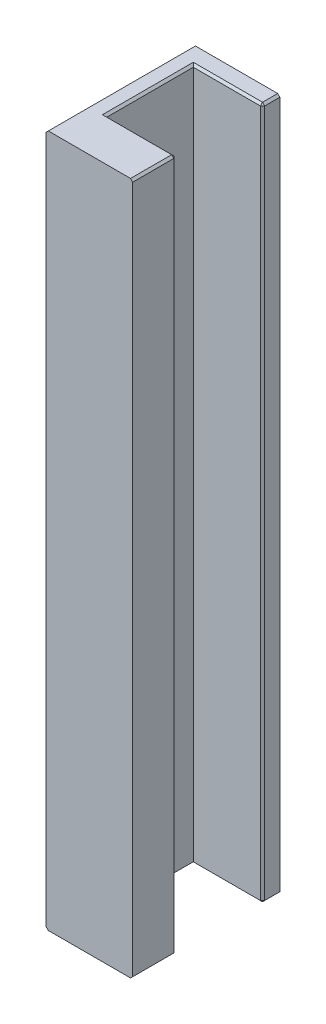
ISO-10303-21;
HEADER;
FILE_DESCRIPTION(('STEP AP214'),'2;1');
FILE_NAME('part.step','',(''),(''),'','','');
FILE_SCHEMA(('AUTOMOTIVE_DESIGN { 1 0 10303 214 1 1 1 1 }'));
ENDSEC;
DATA;
#1=APPLICATION_CONTEXT('core data for automotive mechanical design processes');
#2=APPLICATION_PROTOCOL_DEFINITION('international standard','automotive_design',2000,#1);
#3=PRODUCT_CONTEXT('',#1,'mechanical');
#4=PRODUCT('Part','Part','',(#3));
#5=PRODUCT_RELATED_PRODUCT_CATEGORY('part','',(#4));
#6=PRODUCT_DEFINITION_FORMATION('','',#4);
#7=PRODUCT_DEFINITION_CONTEXT('part definition',#1,'design');
#8=PRODUCT_DEFINITION('design','',#6,#7);
#9=PRODUCT_DEFINITION_SHAPE('','',#8);
#10=(LENGTH_UNIT() NAMED_UNIT(*) SI_UNIT(.MILLI.,.METRE.));
#11=(NAMED_UNIT(*) PLANE_ANGLE_UNIT() SI_UNIT($,.RADIAN.));
#12=(NAMED_UNIT(*) SI_UNIT($,.STERADIAN.) SOLID_ANGLE_UNIT());
#13=UNCERTAINTY_MEASURE_WITH_UNIT(LENGTH_MEASURE(1.E-05),#10,'distance_accuracy_value','');
#14=(GEOMETRIC_REPRESENTATION_CONTEXT(3) GLOBAL_UNCERTAINTY_ASSIGNED_CONTEXT((#13)) GLOBAL_UNIT_ASSIGNED_CONTEXT((#10,
#11,#12)) REPRESENTATION_CONTEXT('',''));
#15=CARTESIAN_POINT('',(0.,0.,0.));
#16=DIRECTION('',(0.,0.,1.));
#17=DIRECTION('',(1.,0.,0.));
#18=AXIS2_PLACEMENT_3D('',#15,#16,#17);
#19=CARTESIAN_POINT('',(9.,80.,0.));
#20=DIRECTION('',(1.,0.,0.));
#21=DIRECTION('',(0.,0.,-1.));
#22=AXIS2_PLACEMENT_3D('',#19,#20,#21);
#23=PLANE('',#22);
#24=DIRECTION('',(0.,-1.,0.));
#25=VECTOR('',#24,1.);
#26=CARTESIAN_POINT('',(8.99999999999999,80.,9.99999999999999));
#27=LINE('',#26,#25);
#28=CARTESIAN_POINT('',(8.99999999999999,79.75,9.99999999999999));
#29=VERTEX_POINT('',#28);
#30=CARTESIAN_POINT('',(8.99999999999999,0.250000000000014,9.99999999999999));
#31=VERTEX_POINT('',#30);
#32=EDGE_CURVE('E189',#29,#31,#27,.T.);
#33=ORIENTED_EDGE('',*,*,#32,.T.);
#34=DIRECTION('',(0.,0.,-1.));
#35=VECTOR('',#34,1.);
#36=CARTESIAN_POINT('',(8.99999999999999,0.250000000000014,4.99999999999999));
#37=LINE('',#36,#35);
#38=CARTESIAN_POINT('',(8.99999999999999,0.250000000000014,5.25));
#39=VERTEX_POINT('',#38);
#40=EDGE_CURVE('E266',#31,#39,#37,.T.);
#41=ORIENTED_EDGE('',*,*,#40,.T.);
#42=DIRECTION('',(0.,1.,0.));
#43=VECTOR('',#42,1.);
#44=CARTESIAN_POINT('',(8.99999999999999,80.,5.25));
#45=LINE('',#44,#43);
#46=CARTESIAN_POINT('',(8.99999999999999,79.75,5.25));
#47=VERTEX_POINT('',#46);
#48=EDGE_CURVE('E260',#39,#47,#45,.T.);
#49=ORIENTED_EDGE('',*,*,#48,.T.);
#50=DIRECTION('',(0.,0.,1.));
#51=VECTOR('',#50,1.);
#52=CARTESIAN_POINT('',(9.,79.75,0.));
#53=LINE('',#52,#51);
#54=EDGE_CURVE('E263',#47,#29,#53,.T.);
#55=ORIENTED_EDGE('',*,*,#54,.T.);
#56=EDGE_LOOP('',(#33,#41,#49,#55));
#57=FACE_BOUND('',#56,.T.);
#58=ADVANCED_FACE('F40',(#57),#23,.T.);
#59=CARTESIAN_POINT('',(0.,80.,4.99999999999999));
#60=DIRECTION('',(0.,0.,-1.));
#61=DIRECTION('',(-1.,0.,0.));
#62=AXIS2_PLACEMENT_3D('',#59,#60,#61);
#63=PLANE('',#62);
#64=DIRECTION('',(0.,-1.,0.));
#65=VECTOR('',#64,1.);
#66=CARTESIAN_POINT('',(0.999999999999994,80.,4.99999999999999));
#67=LINE('',#66,#65);
#68=CARTESIAN_POINT('',(0.999999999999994,79.75,4.99999999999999));
#69=VERTEX_POINT('',#68);
#70=CARTESIAN_POINT('',(0.999999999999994,0.250000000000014,4.99999999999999));
#71=VERTEX_POINT('',#70);
#72=EDGE_CURVE('E195',#69,#71,#67,.T.);
#73=ORIENTED_EDGE('',*,*,#72,.F.);
#74=DIRECTION('',(1.,0.,0.));
#75=VECTOR('',#74,1.);
#76=CARTESIAN_POINT('',(0.,79.75,4.99999999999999));
#77=LINE('',#76,#75);
#78=CARTESIAN_POINT('',(8.74999999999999,79.75,4.99999999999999));
#79=VERTEX_POINT('',#78);
#80=EDGE_CURVE('E11',#69,#79,#77,.T.);
#81=ORIENTED_EDGE('',*,*,#80,.T.);
#82=DIRECTION('',(0.,-1.,0.));
#83=VECTOR('',#82,1.);
#84=CARTESIAN_POINT('',(8.74999999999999,80.,4.99999999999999));
#85=LINE('',#84,#83);
#86=CARTESIAN_POINT('',(8.74999999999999,0.250000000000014,4.99999999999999));
#87=VERTEX_POINT('',#86);
#88=EDGE_CURVE('E50',#79,#87,#85,.T.);
#89=ORIENTED_EDGE('',*,*,#88,.T.);
#90=DIRECTION('',(-1.,0.,0.));
#91=VECTOR('',#90,1.);
#92=CARTESIAN_POINT('',(0.999999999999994,0.250000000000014,4.99999999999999));
#93=LINE('',#92,#91);
#94=EDGE_CURVE('E294',#87,#71,#93,.T.);
#95=ORIENTED_EDGE('',*,*,#94,.T.);
#96=EDGE_LOOP('',(#73,#81,#89,#95));
#97=FACE_BOUND('',#96,.T.);
#98=ADVANCED_FACE('F430',(#97),#63,.T.);
#99=CARTESIAN_POINT('',(0.999999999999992,80.,0.));
#100=DIRECTION('',(1.,0.,0.));
#101=DIRECTION('',(0.,0.,-1.));
#102=AXIS2_PLACEMENT_3D('',#99,#100,#101);
#103=PLANE('',#102);
#104=DIRECTION('',(0.,-1.,0.));
#105=VECTOR('',#104,1.);
#106=CARTESIAN_POINT('',(0.99999999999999,80.,-5.00000000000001));
#107=LINE('',#106,#105);
#108=CARTESIAN_POINT('',(0.99999999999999,79.75,-5.00000000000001));
#109=VERTEX_POINT('',#108);
#110=CARTESIAN_POINT('',(0.99999999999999,0.250000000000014,-5.00000000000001));
#111=VERTEX_POINT('',#110);
#112=EDGE_CURVE('E202',#109,#111,#107,.T.);
#113=ORIENTED_EDGE('',*,*,#112,.F.);
#114=DIRECTION('',(0.,0.,1.));
#115=VECTOR('',#114,1.);
#116=CARTESIAN_POINT('',(0.999999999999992,79.75,0.));
#117=LINE('',#116,#115);
#118=EDGE_CURVE('E291',#109,#69,#117,.T.);
#119=ORIENTED_EDGE('',*,*,#118,.T.);
#120=ORIENTED_EDGE('',*,*,#72,.T.);
#121=DIRECTION('',(0.,0.,-1.));
#122=VECTOR('',#121,1.);
#123=CARTESIAN_POINT('',(0.99999999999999,0.250000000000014,-5.00000000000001));
#124=LINE('',#123,#122);
#125=EDGE_CURVE('E288',#71,#111,#124,.T.);
#126=ORIENTED_EDGE('',*,*,#125,.T.);
#127=EDGE_LOOP('',(#113,#119,#120,#126));
#128=FACE_BOUND('',#127,.T.);
#129=ADVANCED_FACE('F429',(#128),#103,.T.);
#130=CARTESIAN_POINT('',(0.,80.,-5.00000000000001));
#131=DIRECTION('',(0.,0.,-1.));
#132=DIRECTION('',(-1.,0.,0.));
#133=AXIS2_PLACEMENT_3D('',#130,#131,#132);
#134=PLANE('',#133);
#135=DIRECTION('',(0.,1.,0.));
#136=VECTOR('',#135,1.);
#137=CARTESIAN_POINT('',(8.74999999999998,80.,-5.00000000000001));
#138=LINE('',#137,#136);
#139=CARTESIAN_POINT('',(8.74999999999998,0.250000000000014,-5.00000000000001));
#140=VERTEX_POINT('',#139);
#141=CARTESIAN_POINT('',(8.74999999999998,79.75,-5.00000000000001));
#142=VERTEX_POINT('',#141);
#143=EDGE_CURVE('E278',#140,#142,#138,.T.);
#144=ORIENTED_EDGE('',*,*,#143,.T.);
#145=DIRECTION('',(-1.,0.,0.));
#146=VECTOR('',#145,1.);
#147=CARTESIAN_POINT('',(0.99999999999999,79.75,-5.00000000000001));
#148=LINE('',#147,#146);
#149=EDGE_CURVE('E284',#142,#109,#148,.T.);
#150=ORIENTED_EDGE('',*,*,#149,.T.);
#151=ORIENTED_EDGE('',*,*,#112,.T.);
#152=DIRECTION('',(1.,0.,0.));
#153=VECTOR('',#152,1.);
#154=CARTESIAN_POINT('',(0.,0.250000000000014,-5.00000000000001));
#155=LINE('',#154,#153);
#156=EDGE_CURVE('E281',#111,#140,#155,.T.);
#157=ORIENTED_EDGE('',*,*,#156,.T.);
#158=EDGE_LOOP('',(#144,#150,#151,#157));
#159=FACE_BOUND('',#158,.T.);
#160=ADVANCED_FACE('F394',(#159),#134,.F.);
#161=CARTESIAN_POINT('',(8.99999999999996,80.,0.));
#162=DIRECTION('',(-1.,0.,0.));
#163=DIRECTION('',(0.,0.,1.));
#164=AXIS2_PLACEMENT_3D('',#161,#162,#163);
#165=PLANE('',#164);
#166=DIRECTION('',(0.,-1.,0.));
#167=VECTOR('',#166,1.);
#168=CARTESIAN_POINT('',(8.99999999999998,80.,-5.25000000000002));
#169=LINE('',#168,#167);
#170=CARTESIAN_POINT('',(8.99999999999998,79.75,-5.25000000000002));
#171=VERTEX_POINT('',#170);
#172=CARTESIAN_POINT('',(8.99999999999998,0.250000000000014,-5.25000000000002));
#173=VERTEX_POINT('',#172);
#174=EDGE_CURVE('E269',#171,#173,#169,.T.);
#175=ORIENTED_EDGE('',*,*,#174,.T.);
#176=DIRECTION('',(0.,0.,-1.));
#177=VECTOR('',#176,1.);
#178=CARTESIAN_POINT('',(8.99999999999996,0.250000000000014,0.));
#179=LINE('',#178,#177);
#180=CARTESIAN_POINT('',(8.99999999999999,0.250000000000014,-7.00000000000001));
#181=VERTEX_POINT('',#180);
#182=EDGE_CURVE('E275',#173,#181,#179,.T.);
#183=ORIENTED_EDGE('',*,*,#182,.T.);
#184=DIRECTION('',(0.,-1.,0.));
#185=VECTOR('',#184,1.);
#186=CARTESIAN_POINT('',(8.99999999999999,80.,-7.00000000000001));
#187=LINE('',#186,#185);
#188=CARTESIAN_POINT('',(8.99999999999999,79.75,-7.00000000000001));
#189=VERTEX_POINT('',#188);
#190=EDGE_CURVE('E386',#189,#181,#187,.T.);
#191=ORIENTED_EDGE('',*,*,#190,.F.);
#192=DIRECTION('',(0.,0.,1.));
#193=VECTOR('',#192,1.);
#194=CARTESIAN_POINT('',(8.99999999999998,79.75,-5.00000000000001));
#195=LINE('',#194,#193);
#196=EDGE_CURVE('E272',#189,#171,#195,.T.);
#197=ORIENTED_EDGE('',*,*,#196,.T.);
#198=EDGE_LOOP('',(#175,#183,#191,#197));
#199=FACE_BOUND('',#198,.T.);
#200=ADVANCED_FACE('F456',(#199),#165,.F.);
#201=CARTESIAN_POINT('',(0.,80.,-7.00000000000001));
#202=DIRECTION('',(0.,0.,-1.));
#203=DIRECTION('',(-1.,0.,0.));
#204=AXIS2_PLACEMENT_3D('',#201,#202,#203);
#205=PLANE('',#204);
#206=DIRECTION('',(1.,0.,0.));
#207=VECTOR('',#206,1.);
#208=CARTESIAN_POINT('',(0.,0.,-7.00000000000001));
#209=LINE('',#208,#207);
#210=CARTESIAN_POINT('',(-0.750000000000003,0.,-7.00000000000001));
#211=VERTEX_POINT('',#210);
#212=CARTESIAN_POINT('',(8.74999999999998,0.,-7.00000000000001));
#213=VERTEX_POINT('',#212);
#214=EDGE_CURVE('E363',#211,#213,#209,.T.);
#215=ORIENTED_EDGE('',*,*,#214,.F.);
#216=DIRECTION('',(0.707106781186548,-0.707106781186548,0.));
#217=VECTOR('',#216,1.);
#218=CARTESIAN_POINT('',(-40.375,39.625,-7.00000000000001));
#219=LINE('',#218,#217);
#220=CARTESIAN_POINT('',(-1.00000000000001,0.25,-7.00000000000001));
#221=VERTEX_POINT('',#220);
#222=EDGE_CURVE('E239',#211,#221,#219,.F.);
#223=ORIENTED_EDGE('',*,*,#222,.T.);
#224=DIRECTION('',(0.,-1.,0.));
#225=VECTOR('',#224,1.);
#226=CARTESIAN_POINT('',(-1.00000000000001,80.,-7.00000000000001));
#227=LINE('',#226,#225);
#228=CARTESIAN_POINT('',(-1.00000000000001,79.75,-7.00000000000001));
#229=VERTEX_POINT('',#228);
#230=EDGE_CURVE('E188',#229,#221,#227,.T.);
#231=ORIENTED_EDGE('',*,*,#230,.F.);
#232=DIRECTION('',(0.707106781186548,0.707106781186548,0.));
#233=VECTOR('',#232,1.);
#234=CARTESIAN_POINT('',(-0.375000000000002,80.375,-7.00000000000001));
#235=LINE('',#234,#233);
#236=CARTESIAN_POINT('',(-0.750000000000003,80.,-7.00000000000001));
#237=VERTEX_POINT('',#236);
#238=EDGE_CURVE('E193',#229,#237,#235,.T.);
#239=ORIENTED_EDGE('',*,*,#238,.T.);
#240=DIRECTION('',(1.,0.,0.));
#241=VECTOR('',#240,1.);
#242=CARTESIAN_POINT('',(0.,80.,-7.00000000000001));
#243=LINE('',#242,#241);
#244=CARTESIAN_POINT('',(8.74999999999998,80.,-7.00000000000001));
#245=VERTEX_POINT('',#244);
#246=EDGE_CURVE('E376',#237,#245,#243,.T.);
#247=ORIENTED_EDGE('',*,*,#246,.T.);
#248=DIRECTION('',(0.707106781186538,-0.707106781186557,0.));
#249=VECTOR('',#248,1.);
#250=CARTESIAN_POINT('',(4.37500000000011,84.375,-7.00000000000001));
#251=LINE('',#250,#249);
#252=EDGE_CURVE('E231',#245,#189,#251,.T.);
#253=ORIENTED_EDGE('',*,*,#252,.T.);
#254=ORIENTED_EDGE('',*,*,#190,.T.);
#255=DIRECTION('',(0.707106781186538,0.707106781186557,0.));
#256=VECTOR('',#255,1.);
#257=CARTESIAN_POINT('',(44.3750000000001,35.6250000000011,-7.00000000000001));
#258=LINE('',#257,#256);
#259=EDGE_CURVE('E234',#181,#213,#258,.F.);
#260=ORIENTED_EDGE('',*,*,#259,.T.);
#261=EDGE_LOOP('',(#215,#223,#231,#239,#247,#253,#254,#260));
#262=FACE_BOUND('',#261,.T.);
#263=ADVANCED_FACE('F450',(#262),#205,.T.);
#264=CARTESIAN_POINT('',(-1.00000000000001,80.,0.));
#265=DIRECTION('',(1.,0.,0.));
#266=DIRECTION('',(0.,0.,-1.));
#267=AXIS2_PLACEMENT_3D('',#264,#265,#266);
#268=PLANE('',#267);
#269=ORIENTED_EDGE('',*,*,#230,.T.);
#270=DIRECTION('',(0.,0.,1.));
#271=VECTOR('',#270,1.);
#272=CARTESIAN_POINT('',(-1.00000000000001,0.25,0.));
#273=LINE('',#272,#271);
#274=CARTESIAN_POINT('',(-1.00000000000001,0.25,9.99999999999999));
#275=VERTEX_POINT('',#274);
#276=EDGE_CURVE('E186',#221,#275,#273,.T.);
#277=ORIENTED_EDGE('',*,*,#276,.T.);
#278=DIRECTION('',(0.,-1.,0.));
#279=VECTOR('',#278,1.);
#280=CARTESIAN_POINT('',(-1.00000000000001,80.,9.99999999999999));
#281=LINE('',#280,#279);
#282=CARTESIAN_POINT('',(-1.00000000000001,79.75,9.99999999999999));
#283=VERTEX_POINT('',#282);
#284=EDGE_CURVE('E168',#283,#275,#281,.T.);
#285=ORIENTED_EDGE('',*,*,#284,.F.);
#286=DIRECTION('',(0.,0.,-1.));
#287=VECTOR('',#286,1.);
#288=CARTESIAN_POINT('',(-1.,79.75,-7.00000000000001));
#289=LINE('',#288,#287);
#290=EDGE_CURVE('E183',#283,#229,#289,.T.);
#291=ORIENTED_EDGE('',*,*,#290,.T.);
#292=EDGE_LOOP('',(#269,#277,#285,#291));
#293=FACE_BOUND('',#292,.T.);
#294=ADVANCED_FACE('F182',(#293),#268,.F.);
#295=CARTESIAN_POINT('',(0.,80.,9.99999999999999));
#296=DIRECTION('',(0.,0.,-1.));
#297=DIRECTION('',(-1.,0.,0.));
#298=AXIS2_PLACEMENT_3D('',#295,#296,#297);
#299=PLANE('',#298);
#300=ORIENTED_EDGE('',*,*,#284,.T.);
#301=DIRECTION('',(-0.707106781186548,0.707106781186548,0.));
#302=VECTOR('',#301,1.);
#303=CARTESIAN_POINT('',(-1.00000000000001,0.249999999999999,9.99999999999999));
#304=LINE('',#303,#302);
#305=CARTESIAN_POINT('',(-0.750000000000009,0.,9.99999999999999));
#306=VERTEX_POINT('',#305);
#307=EDGE_CURVE('E176',#275,#306,#304,.F.);
#308=ORIENTED_EDGE('',*,*,#307,.T.);
#309=DIRECTION('',(1.,0.,0.));
#310=VECTOR('',#309,1.);
#311=CARTESIAN_POINT('',(0.,0.,9.99999999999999));
#312=LINE('',#311,#310);
#313=CARTESIAN_POINT('',(8.74999999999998,0.,9.99999999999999));
#314=VERTEX_POINT('',#313);
#315=EDGE_CURVE('E369',#306,#314,#312,.T.);
#316=ORIENTED_EDGE('',*,*,#315,.T.);
#317=DIRECTION('',(0.707106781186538,0.707106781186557,0.));
#318=VECTOR('',#317,1.);
#319=CARTESIAN_POINT('',(8.74999999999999,0.,9.99999999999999));
#320=LINE('',#319,#318);
#321=EDGE_CURVE('E177',#314,#31,#320,.T.);
#322=ORIENTED_EDGE('',*,*,#321,.T.);
#323=ORIENTED_EDGE('',*,*,#32,.F.);
#324=DIRECTION('',(0.707106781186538,-0.707106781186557,0.));
#325=VECTOR('',#324,1.);
#326=CARTESIAN_POINT('',(8.99999999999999,79.75,9.99999999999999));
#327=LINE('',#326,#325);
#328=CARTESIAN_POINT('',(8.74999999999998,80.,9.99999999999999));
#329=VERTEX_POINT('',#328);
#330=EDGE_CURVE('E199',#29,#329,#327,.F.);
#331=ORIENTED_EDGE('',*,*,#330,.T.);
#332=DIRECTION('',(1.,0.,0.));
#333=VECTOR('',#332,1.);
#334=CARTESIAN_POINT('',(0.,80.,9.99999999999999));
#335=LINE('',#334,#333);
#336=CARTESIAN_POINT('',(-0.750000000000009,80.,9.99999999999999));
#337=VERTEX_POINT('',#336);
#338=EDGE_CURVE('E170',#337,#329,#335,.T.);
#339=ORIENTED_EDGE('',*,*,#338,.F.);
#340=DIRECTION('',(-0.707106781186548,-0.707106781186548,0.));
#341=VECTOR('',#340,1.);
#342=CARTESIAN_POINT('',(-0.750000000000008,80.,9.99999999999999));
#343=LINE('',#342,#341);
#344=EDGE_CURVE('E165',#337,#283,#343,.T.);
#345=ORIENTED_EDGE('',*,*,#344,.T.);
#346=EDGE_LOOP('',(#300,#308,#316,#322,#323,#331,#339,#345));
#347=FACE_BOUND('',#346,.T.);
#348=ADVANCED_FACE('F167',(#347),#299,.F.);
#349=CARTESIAN_POINT('',(0.,80.,0.));
#350=DIRECTION('',(0.,1.,0.));
#351=DIRECTION('',(0.,0.,1.));
#352=AXIS2_PLACEMENT_3D('',#349,#350,#351);
#353=PLANE('',#352);
#354=ORIENTED_EDGE('',*,*,#246,.F.);
#355=DIRECTION('',(0.,0.,1.));
#356=VECTOR('',#355,1.);
#357=CARTESIAN_POINT('',(-0.750000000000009,80.,9.99999999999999));
#358=LINE('',#357,#356);
#359=EDGE_CURVE('E257',#237,#337,#358,.T.);
#360=ORIENTED_EDGE('',*,*,#359,.T.);
#361=ORIENTED_EDGE('',*,*,#338,.T.);
#362=DIRECTION('',(0.,0.,-1.));
#363=VECTOR('',#362,1.);
#364=CARTESIAN_POINT('',(8.74999999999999,80.,0.));
#365=LINE('',#364,#363);
#366=CARTESIAN_POINT('',(8.74999999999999,80.,5.25));
#367=VERTEX_POINT('',#366);
#368=EDGE_CURVE('E251',#329,#367,#365,.T.);
#369=ORIENTED_EDGE('',*,*,#368,.T.);
#370=DIRECTION('',(-1.,0.,0.));
#371=VECTOR('',#370,1.);
#372=CARTESIAN_POINT('',(0.,80.,5.25));
#373=LINE('',#372,#371);
#374=CARTESIAN_POINT('',(0.749999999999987,80.,5.25));
#375=VERTEX_POINT('',#374);
#376=EDGE_CURVE('E242',#367,#375,#373,.T.);
#377=ORIENTED_EDGE('',*,*,#376,.T.);
#378=DIRECTION('',(0.,0.,-1.));
#379=VECTOR('',#378,1.);
#380=CARTESIAN_POINT('',(0.749999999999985,80.,0.));
#381=LINE('',#380,#379);
#382=CARTESIAN_POINT('',(0.749999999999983,80.,-5.25000000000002));
#383=VERTEX_POINT('',#382);
#384=EDGE_CURVE('E245',#375,#383,#381,.T.);
#385=ORIENTED_EDGE('',*,*,#384,.T.);
#386=DIRECTION('',(1.,0.,0.));
#387=VECTOR('',#386,1.);
#388=CARTESIAN_POINT('',(8.99999999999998,80.,-5.25000000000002));
#389=LINE('',#388,#387);
#390=CARTESIAN_POINT('',(8.74999999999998,80.,-5.25000000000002));
#391=VERTEX_POINT('',#390);
#392=EDGE_CURVE('E248',#383,#391,#389,.T.);
#393=ORIENTED_EDGE('',*,*,#392,.T.);
#394=DIRECTION('',(0.,0.,-1.));
#395=VECTOR('',#394,1.);
#396=CARTESIAN_POINT('',(8.74999999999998,80.,-7.00000000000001));
#397=LINE('',#396,#395);
#398=EDGE_CURVE('E254',#391,#245,#397,.T.);
#399=ORIENTED_EDGE('',*,*,#398,.T.);
#400=EDGE_LOOP('',(#354,#360,#361,#369,#377,#385,#393,#399));
#401=FACE_BOUND('',#400,.T.);
#402=ADVANCED_FACE('F461',(#401),#353,.T.);
#403=CARTESIAN_POINT('',(0.,0.,0.));
#404=DIRECTION('',(0.,1.,0.));
#405=DIRECTION('',(0.,0.,1.));
#406=AXIS2_PLACEMENT_3D('',#403,#404,#405);
#407=PLANE('',#406);
#408=ORIENTED_EDGE('',*,*,#315,.F.);
#409=DIRECTION('',(0.,0.,-1.));
#410=VECTOR('',#409,1.);
#411=CARTESIAN_POINT('',(-0.750000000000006,0.,0.));
#412=LINE('',#411,#410);
#413=EDGE_CURVE('E228',#306,#211,#412,.T.);
#414=ORIENTED_EDGE('',*,*,#413,.T.);
#415=ORIENTED_EDGE('',*,*,#214,.T.);
#416=DIRECTION('',(0.,0.,1.));
#417=VECTOR('',#416,1.);
#418=CARTESIAN_POINT('',(8.74999999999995,0.,0.));
#419=LINE('',#418,#417);
#420=CARTESIAN_POINT('',(8.74999999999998,0.,-5.25000000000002));
#421=VERTEX_POINT('',#420);
#422=EDGE_CURVE('E221',#213,#421,#419,.T.);
#423=ORIENTED_EDGE('',*,*,#422,.T.);
#424=DIRECTION('',(-1.,0.,0.));
#425=VECTOR('',#424,1.);
#426=CARTESIAN_POINT('',(0.,0.,-5.25000000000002));
#427=LINE('',#426,#425);
#428=CARTESIAN_POINT('',(0.749999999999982,0.,-5.25000000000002));
#429=VERTEX_POINT('',#428);
#430=EDGE_CURVE('E212',#421,#429,#427,.T.);
#431=ORIENTED_EDGE('',*,*,#430,.T.);
#432=DIRECTION('',(0.,0.,1.));
#433=VECTOR('',#432,1.);
#434=CARTESIAN_POINT('',(0.749999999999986,0.,4.99999999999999));
#435=LINE('',#434,#433);
#436=CARTESIAN_POINT('',(0.749999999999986,0.,5.25));
#437=VERTEX_POINT('',#436);
#438=EDGE_CURVE('E215',#429,#437,#435,.T.);
#439=ORIENTED_EDGE('',*,*,#438,.T.);
#440=DIRECTION('',(1.,0.,0.));
#441=VECTOR('',#440,1.);
#442=CARTESIAN_POINT('',(8.99999999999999,0.,5.25));
#443=LINE('',#442,#441);
#444=CARTESIAN_POINT('',(8.74999999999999,0.,5.25));
#445=VERTEX_POINT('',#444);
#446=EDGE_CURVE('E218',#437,#445,#443,.T.);
#447=ORIENTED_EDGE('',*,*,#446,.T.);
#448=DIRECTION('',(0.,0.,1.));
#449=VECTOR('',#448,1.);
#450=CARTESIAN_POINT('',(8.74999999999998,0.,9.99999999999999));
#451=LINE('',#450,#449);
#452=EDGE_CURVE('E224',#445,#314,#451,.T.);
#453=ORIENTED_EDGE('',*,*,#452,.T.);
#454=EDGE_LOOP('',(#408,#414,#415,#423,#431,#439,#447,#453));
#455=FACE_BOUND('',#454,.T.);
#456=ADVANCED_FACE('F409',(#455),#407,.F.);
#457=CARTESIAN_POINT('',(-1.00000000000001,0.25,0.));
#458=DIRECTION('',(0.707106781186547,0.707106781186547,0.));
#459=DIRECTION('',(0.,0.,1.));
#460=AXIS2_PLACEMENT_3D('',#457,#458,#459);
#461=PLANE('',#460);
#462=ORIENTED_EDGE('',*,*,#222,.F.);
#463=ORIENTED_EDGE('',*,*,#413,.F.);
#464=ORIENTED_EDGE('',*,*,#307,.F.);
#465=ORIENTED_EDGE('',*,*,#276,.F.);
#466=EDGE_LOOP('',(#462,#463,#464,#465));
#467=FACE_BOUND('',#466,.T.);
#468=ADVANCED_FACE('F448',(#467),#461,.F.);
#469=CARTESIAN_POINT('',(-0.750000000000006,80.,0.));
#470=DIRECTION('',(-0.707106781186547,0.707106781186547,0.));
#471=DIRECTION('',(0.,0.,-1.));
#472=AXIS2_PLACEMENT_3D('',#469,#470,#471);
#473=PLANE('',#472);
#474=ORIENTED_EDGE('',*,*,#238,.F.);
#475=ORIENTED_EDGE('',*,*,#290,.F.);
#476=ORIENTED_EDGE('',*,*,#344,.F.);
#477=ORIENTED_EDGE('',*,*,#359,.F.);
#478=EDGE_LOOP('',(#474,#475,#476,#477));
#479=FACE_BOUND('',#478,.T.);
#480=ADVANCED_FACE('F192',(#479),#473,.T.);
#481=CARTESIAN_POINT('',(8.74999999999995,80.,0.));
#482=DIRECTION('',(0.707106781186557,0.707106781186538,0.));
#483=DIRECTION('',(0.,0.,1.));
#484=AXIS2_PLACEMENT_3D('',#481,#482,#483);
#485=PLANE('',#484);
#486=DIRECTION('',(-0.707106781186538,0.707106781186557,0.));
#487=VECTOR('',#486,1.);
#488=CARTESIAN_POINT('',(8.99999999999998,79.75,-5.25000000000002));
#489=LINE('',#488,#487);
#490=EDGE_CURVE('E44',#171,#391,#489,.T.);
#491=ORIENTED_EDGE('',*,*,#490,.F.);
#492=ORIENTED_EDGE('',*,*,#196,.F.);
#493=ORIENTED_EDGE('',*,*,#252,.F.);
#494=ORIENTED_EDGE('',*,*,#398,.F.);
#495=EDGE_LOOP('',(#491,#492,#493,#494));
#496=FACE_BOUND('',#495,.T.);
#497=ADVANCED_FACE('F42',(#496),#485,.T.);
#498=CARTESIAN_POINT('',(8.99999999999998,79.75,-5.25000000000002));
#499=DIRECTION('',(0.577350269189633,0.577350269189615,0.577350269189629));
#500=DIRECTION('',(0.707106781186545,0.,-0.70710678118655));
#501=AXIS2_PLACEMENT_3D('',#498,#499,#500);
#502=PLANE('',#501);
#503=DIRECTION('',(-0.707106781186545,0.,0.70710678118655));
#504=VECTOR('',#503,1.);
#505=CARTESIAN_POINT('',(8.99999999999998,79.75,-5.25000000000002));
#506=LINE('',#505,#504);
#507=EDGE_CURVE('E351',#171,#142,#506,.T.);
#508=ORIENTED_EDGE('',*,*,#507,.F.);
#509=ORIENTED_EDGE('',*,*,#490,.T.);
#510=DIRECTION('',(0.,-0.707106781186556,0.707106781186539));
#511=VECTOR('',#510,1.);
#512=CARTESIAN_POINT('',(8.74999999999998,79.875,-5.12500000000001));
#513=LINE('',#512,#511);
#514=EDGE_CURVE('E354',#142,#391,#513,.F.);
#515=ORIENTED_EDGE('',*,*,#514,.F.);
#516=EDGE_LOOP('',(#508,#509,#515));
#517=FACE_BOUND('',#516,.T.);
#518=ADVANCED_FACE('F422',(#517),#502,.T.);
#519=CARTESIAN_POINT('',(0.,80.,-5.25000000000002));
#520=DIRECTION('',(0.,0.707106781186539,0.707106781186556));
#521=DIRECTION('',(-1.,0.,0.));
#522=AXIS2_PLACEMENT_3D('',#519,#520,#521);
#523=PLANE('',#522);
#524=ORIENTED_EDGE('',*,*,#514,.T.);
#525=ORIENTED_EDGE('',*,*,#392,.F.);
#526=DIRECTION('',(0.57735026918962,-0.577350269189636,0.577350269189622));
#527=VECTOR('',#526,1.);
#528=CARTESIAN_POINT('',(0.499999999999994,80.25,-5.50000000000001));
#529=LINE('',#528,#527);
#530=EDGE_CURVE('E347',#109,#383,#529,.F.);
#531=ORIENTED_EDGE('',*,*,#530,.F.);
#532=ORIENTED_EDGE('',*,*,#149,.F.);
#533=EDGE_LOOP('',(#524,#525,#531,#532));
#534=FACE_BOUND('',#533,.T.);
#535=ADVANCED_FACE('F424',(#534),#523,.T.);
#536=CARTESIAN_POINT('',(8.99999999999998,80.,-5.25000000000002));
#537=DIRECTION('',(-0.70710678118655,0.,-0.707106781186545));
#538=DIRECTION('',(0.,-1.,0.));
#539=AXIS2_PLACEMENT_3D('',#536,#537,#538);
#540=PLANE('',#539);
#541=ORIENTED_EDGE('',*,*,#507,.T.);
#542=ORIENTED_EDGE('',*,*,#143,.F.);
#543=DIRECTION('',(0.707106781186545,0.,-0.70710678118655));
#544=VECTOR('',#543,1.);
#545=CARTESIAN_POINT('',(8.87499999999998,0.250000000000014,-5.12500000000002));
#546=LINE('',#545,#544);
#547=EDGE_CURVE('E343',#173,#140,#546,.F.);
#548=ORIENTED_EDGE('',*,*,#547,.F.);
#549=ORIENTED_EDGE('',*,*,#174,.F.);
#550=EDGE_LOOP('',(#541,#542,#548,#549));
#551=FACE_BOUND('',#550,.T.);
#552=ADVANCED_FACE('F421',(#551),#540,.F.);
#553=CARTESIAN_POINT('',(8.99999999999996,0.250000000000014,0.));
#554=DIRECTION('',(-0.707106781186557,0.707106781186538,0.));
#555=DIRECTION('',(0.,0.,-1.));
#556=AXIS2_PLACEMENT_3D('',#553,#554,#555);
#557=PLANE('',#556);
#558=ORIENTED_EDGE('',*,*,#259,.F.);
#559=ORIENTED_EDGE('',*,*,#182,.F.);
#560=DIRECTION('',(-0.707106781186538,-0.707106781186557,0.));
#561=VECTOR('',#560,1.);
#562=CARTESIAN_POINT('',(8.74999999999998,0.,-5.25000000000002));
#563=LINE('',#562,#561);
#564=EDGE_CURVE('E339',#421,#173,#563,.F.);
#565=ORIENTED_EDGE('',*,*,#564,.F.);
#566=ORIENTED_EDGE('',*,*,#422,.F.);
#567=EDGE_LOOP('',(#558,#559,#565,#566));
#568=FACE_BOUND('',#567,.T.);
#569=ADVANCED_FACE('F415',(#568),#557,.F.);
#570=CARTESIAN_POINT('',(0.999999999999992,79.75,0.));
#571=DIRECTION('',(-0.707106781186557,-0.707106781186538,0.));
#572=DIRECTION('',(0.,0.,1.));
#573=AXIS2_PLACEMENT_3D('',#570,#571,#572);
#574=PLANE('',#573);
#575=ORIENTED_EDGE('',*,*,#530,.T.);
#576=ORIENTED_EDGE('',*,*,#384,.F.);
#577=DIRECTION('',(-0.57735026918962,0.577350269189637,0.577350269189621));
#578=VECTOR('',#577,1.);
#579=CARTESIAN_POINT('',(2.66666666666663,78.0833333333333,3.33333333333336));
#580=LINE('',#579,#578);
#581=EDGE_CURVE('E335',#69,#375,#580,.T.);
#582=ORIENTED_EDGE('',*,*,#581,.F.);
#583=ORIENTED_EDGE('',*,*,#118,.F.);
#584=EDGE_LOOP('',(#575,#576,#582,#583));
#585=FACE_BOUND('',#584,.T.);
#586=ADVANCED_FACE('F427',(#585),#574,.F.);
#587=CARTESIAN_POINT('',(8.74999999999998,0.,-5.25000000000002));
#588=DIRECTION('',(0.577350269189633,-0.577350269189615,0.577350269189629));
#589=DIRECTION('',(0.707106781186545,0.,-0.70710678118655));
#590=AXIS2_PLACEMENT_3D('',#587,#588,#589);
#591=PLANE('',#590);
#592=ORIENTED_EDGE('',*,*,#564,.T.);
#593=ORIENTED_EDGE('',*,*,#547,.T.);
#594=DIRECTION('',(0.,0.707106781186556,0.707106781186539));
#595=VECTOR('',#594,1.);
#596=CARTESIAN_POINT('',(8.74999999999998,0.,-5.25000000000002));
#597=LINE('',#596,#595);
#598=EDGE_CURVE('E331',#421,#140,#597,.T.);
#599=ORIENTED_EDGE('',*,*,#598,.F.);
#600=EDGE_LOOP('',(#592,#593,#599));
#601=FACE_BOUND('',#600,.T.);
#602=ADVANCED_FACE('F418',(#601),#591,.T.);
#603=CARTESIAN_POINT('',(9.,79.75,0.));
#604=DIRECTION('',(-0.707106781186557,-0.707106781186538,0.));
#605=DIRECTION('',(0.,0.,1.));
#606=AXIS2_PLACEMENT_3D('',#603,#604,#605);
#607=PLANE('',#606);
#608=ORIENTED_EDGE('',*,*,#330,.F.);
#609=ORIENTED_EDGE('',*,*,#54,.F.);
#610=DIRECTION('',(-0.707106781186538,0.707106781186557,0.));
#611=VECTOR('',#610,1.);
#612=CARTESIAN_POINT('',(8.74999999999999,80.,5.25));
#613=LINE('',#612,#611);
#614=EDGE_CURVE('E327',#367,#47,#613,.F.);
#615=ORIENTED_EDGE('',*,*,#614,.F.);
#616=ORIENTED_EDGE('',*,*,#368,.F.);
#617=EDGE_LOOP('',(#608,#609,#615,#616));
#618=FACE_BOUND('',#617,.T.);
#619=ADVANCED_FACE('F469',(#618),#607,.F.);
#620=CARTESIAN_POINT('',(0.,79.75,4.99999999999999));
#621=DIRECTION('',(0.,-0.707106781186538,0.707106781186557));
#622=DIRECTION('',(1.,0.,0.));
#623=AXIS2_PLACEMENT_3D('',#620,#621,#622);
#624=PLANE('',#623);
#625=ORIENTED_EDGE('',*,*,#581,.T.);
#626=ORIENTED_EDGE('',*,*,#376,.F.);
#627=DIRECTION('',(0.,-0.707106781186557,-0.707106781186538));
#628=VECTOR('',#627,1.);
#629=CARTESIAN_POINT('',(8.74999999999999,80.,5.25));
#630=LINE('',#629,#628);
#631=EDGE_CURVE('E323',#79,#367,#630,.F.);
#632=ORIENTED_EDGE('',*,*,#631,.F.);
#633=ORIENTED_EDGE('',*,*,#80,.F.);
#634=EDGE_LOOP('',(#625,#626,#632,#633));
#635=FACE_BOUND('',#634,.T.);
#636=ADVANCED_FACE('F475',(#635),#624,.F.);
#637=CARTESIAN_POINT('',(0.,0.250000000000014,-5.00000000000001));
#638=DIRECTION('',(0.,0.707106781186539,-0.707106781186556));
#639=DIRECTION('',(1.,0.,0.));
#640=AXIS2_PLACEMENT_3D('',#637,#638,#639);
#641=PLANE('',#640);
#642=ORIENTED_EDGE('',*,*,#598,.T.);
#643=ORIENTED_EDGE('',*,*,#156,.F.);
#644=DIRECTION('',(0.577350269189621,0.577350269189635,0.577350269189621));
#645=VECTOR('',#644,1.);
#646=CARTESIAN_POINT('',(2.49999999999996,1.75000000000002,-3.50000000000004));
#647=LINE('',#646,#645);
#648=EDGE_CURVE('E319',#429,#111,#647,.T.);
#649=ORIENTED_EDGE('',*,*,#648,.F.);
#650=ORIENTED_EDGE('',*,*,#430,.F.);
#651=EDGE_LOOP('',(#642,#643,#649,#650));
#652=FACE_BOUND('',#651,.T.);
#653=ADVANCED_FACE('F399',(#652),#641,.F.);
#654=CARTESIAN_POINT('',(8.74999999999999,80.,5.25));
#655=DIRECTION('',(0.577350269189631,0.577350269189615,-0.577350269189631));
#656=DIRECTION('',(-0.707106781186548,0.,-0.707106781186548));
#657=AXIS2_PLACEMENT_3D('',#654,#655,#656);
#658=PLANE('',#657);
#659=ORIENTED_EDGE('',*,*,#631,.T.);
#660=ORIENTED_EDGE('',*,*,#614,.T.);
#661=DIRECTION('',(0.707106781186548,0.,0.707106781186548));
#662=VECTOR('',#661,1.);
#663=CARTESIAN_POINT('',(8.87499999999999,79.75,5.12499999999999));
#664=LINE('',#663,#662);
#665=EDGE_CURVE('E315',#79,#47,#664,.T.);
#666=ORIENTED_EDGE('',*,*,#665,.F.);
#667=EDGE_LOOP('',(#659,#660,#666));
#668=FACE_BOUND('',#667,.T.);
#669=ADVANCED_FACE('F473',(#668),#658,.T.);
#670=CARTESIAN_POINT('',(0.749999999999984,0.,0.));
#671=DIRECTION('',(0.707106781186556,-0.707106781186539,0.));
#672=DIRECTION('',(0.,0.,-1.));
#673=AXIS2_PLACEMENT_3D('',#670,#671,#672);
#674=PLANE('',#673);
#675=ORIENTED_EDGE('',*,*,#648,.T.);
#676=ORIENTED_EDGE('',*,*,#125,.F.);
#677=DIRECTION('',(-0.577350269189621,-0.577350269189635,0.577350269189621));
#678=VECTOR('',#677,1.);
#679=CARTESIAN_POINT('',(0.499999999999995,-0.249999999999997,5.49999999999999));
#680=LINE('',#679,#678);
#681=EDGE_CURVE('E311',#437,#71,#680,.F.);
#682=ORIENTED_EDGE('',*,*,#681,.F.);
#683=ORIENTED_EDGE('',*,*,#438,.F.);
#684=EDGE_LOOP('',(#675,#676,#682,#683));
#685=FACE_BOUND('',#684,.T.);
#686=ADVANCED_FACE('F405',(#685),#674,.T.);
#687=CARTESIAN_POINT('',(8.74999999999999,80.,4.99999999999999));
#688=DIRECTION('',(-0.707106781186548,0.,0.707106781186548));
#689=DIRECTION('',(0.,-1.,0.));
#690=AXIS2_PLACEMENT_3D('',#687,#688,#689);
#691=PLANE('',#690);
#692=ORIENTED_EDGE('',*,*,#665,.T.);
#693=ORIENTED_EDGE('',*,*,#48,.F.);
#694=DIRECTION('',(-0.707106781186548,0.,-0.707106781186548));
#695=VECTOR('',#694,1.);
#696=CARTESIAN_POINT('',(8.99999999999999,0.250000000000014,5.25));
#697=LINE('',#696,#695);
#698=EDGE_CURVE('E307',#87,#39,#697,.F.);
#699=ORIENTED_EDGE('',*,*,#698,.F.);
#700=ORIENTED_EDGE('',*,*,#88,.F.);
#701=EDGE_LOOP('',(#692,#693,#699,#700));
#702=FACE_BOUND('',#701,.T.);
#703=ADVANCED_FACE('F437',(#702),#691,.F.);
#704=CARTESIAN_POINT('',(0.,0.,5.25));
#705=DIRECTION('',(0.,-0.707106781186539,-0.707106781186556));
#706=DIRECTION('',(-1.,0.,0.));
#707=AXIS2_PLACEMENT_3D('',#704,#705,#706);
#708=PLANE('',#707);
#709=ORIENTED_EDGE('',*,*,#681,.T.);
#710=ORIENTED_EDGE('',*,*,#94,.F.);
#711=DIRECTION('',(0.,0.707106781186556,-0.707106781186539));
#712=VECTOR('',#711,1.);
#713=CARTESIAN_POINT('',(8.74999999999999,0.12500000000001,5.12499999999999));
#714=LINE('',#713,#712);
#715=EDGE_CURVE('E303',#445,#87,#714,.T.);
#716=ORIENTED_EDGE('',*,*,#715,.F.);
#717=ORIENTED_EDGE('',*,*,#446,.F.);
#718=EDGE_LOOP('',(#709,#710,#716,#717));
#719=FACE_BOUND('',#718,.T.);
#720=ADVANCED_FACE('F433',(#719),#708,.T.);
#721=CARTESIAN_POINT('',(8.99999999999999,0.250000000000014,5.25));
#722=DIRECTION('',(0.57735026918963,-0.577350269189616,-0.57735026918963));
#723=DIRECTION('',(-0.707106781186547,0.,-0.707106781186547));
#724=AXIS2_PLACEMENT_3D('',#721,#722,#723);
#725=PLANE('',#724);
#726=ORIENTED_EDGE('',*,*,#715,.T.);
#727=ORIENTED_EDGE('',*,*,#698,.T.);
#728=DIRECTION('',(-0.707106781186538,-0.707106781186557,0.));
#729=VECTOR('',#728,1.);
#730=CARTESIAN_POINT('',(8.99999999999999,0.250000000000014,5.25));
#731=LINE('',#730,#729);
#732=EDGE_CURVE('E299',#445,#39,#731,.F.);
#733=ORIENTED_EDGE('',*,*,#732,.F.);
#734=EDGE_LOOP('',(#726,#727,#733));
#735=FACE_BOUND('',#734,.T.);
#736=ADVANCED_FACE('F439',(#735),#725,.T.);
#737=CARTESIAN_POINT('',(8.74999999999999,0.,0.));
#738=DIRECTION('',(0.707106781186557,-0.707106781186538,0.));
#739=DIRECTION('',(0.,0.,-1.));
#740=AXIS2_PLACEMENT_3D('',#737,#738,#739);
#741=PLANE('',#740);
#742=ORIENTED_EDGE('',*,*,#732,.T.);
#743=ORIENTED_EDGE('',*,*,#40,.F.);
#744=ORIENTED_EDGE('',*,*,#321,.F.);
#745=ORIENTED_EDGE('',*,*,#452,.F.);
#746=EDGE_LOOP('',(#742,#743,#744,#745));
#747=FACE_BOUND('',#746,.T.);
#748=ADVANCED_FACE('F443',(#747),#741,.T.);
#749=CLOSED_SHELL('',(#58,#98,#129,#160,#200,#263,#294,#348,#402,#456,#468,#480,#497,#518,#535,
#552,#569,#586,#602,#619,#636,#653,#669,#686,#703,#720,#736,#748));
#750=MANIFOLD_SOLID_BREP('B2',#749);
#751=ADVANCED_BREP_SHAPE_REPRESENTATION('',(#18,#750),#14);
#752=SHAPE_DEFINITION_REPRESENTATION(#9,#751);
ENDSEC;
END-ISO-10303-21;
